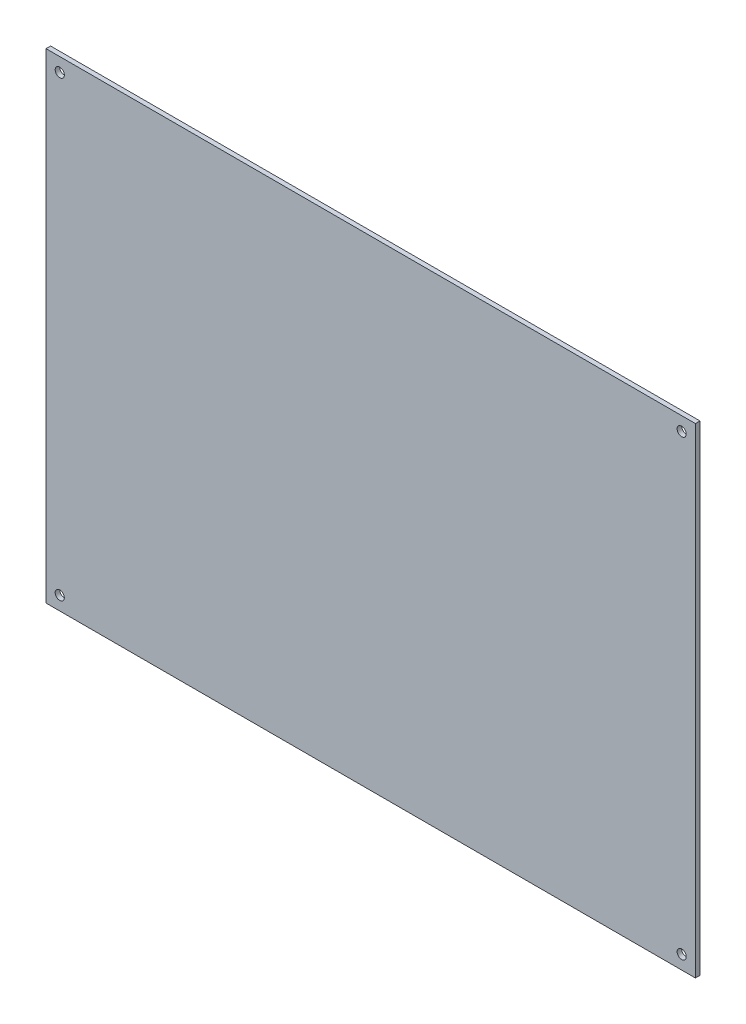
from build123d import *

# Parameters (mm, degrees)
SKETCH1_W           = 360.68
SKETCH1_H           = 266.7
SKETCH1_R           = 2.54
BOSS_EXTRUDE1_DEPTH = 2.54


with BuildPart() as part:
    # Sketch1 → Boss-Extrude1 (new body)
    with BuildSketch(Plane.XY):
        with Locations((-1.895357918, 37.604121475)):
            Rectangle(SKETCH1_W, SKETCH1_H)
        with Locations((-174.615357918, 163.334121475)):
            Circle(SKETCH1_R, mode=Mode.SUBTRACT)
        with Locations((-174.615357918, -88.125878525)):
            Circle(SKETCH1_R, mode=Mode.SUBTRACT)
        with Locations((170.824642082, -88.125878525)):
            Circle(SKETCH1_R, mode=Mode.SUBTRACT)
        with Locations((170.824642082, 163.334121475)):
            Circle(SKETCH1_R, mode=Mode.SUBTRACT)
    extrude(amount=BOSS_EXTRUDE1_DEPTH)


solid = part.part
